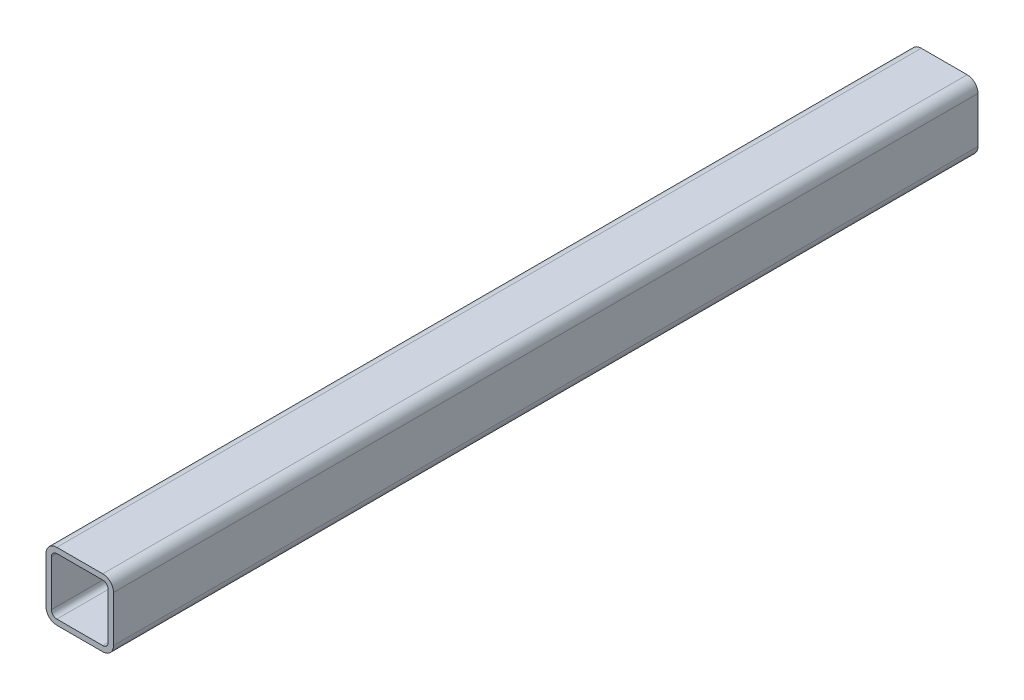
from build123d import *

# Parameters (mm, degrees)
ESQUISSE1_W        = 25
ESQUISSE1_H        = 25
ESQUISSE1_W_2      = 21
ESQUISSE1_H_2      = 21
EXTRU_MINCE1_DEPTH = 160
CONG_1_R           = 2
CONG_2_R           = 4


with BuildPart() as part:
    # Esquisse1 → Extru.-Mince1 (new, symmetric)
    with BuildSketch(Plane.XY):
        Rectangle(ESQUISSE1_W, ESQUISSE1_H)
        Rectangle(ESQUISSE1_W_2, ESQUISSE1_H_2, mode=Mode.SUBTRACT)
    extrude(amount=EXTRU_MINCE1_DEPTH, both=True)

    # Cong_1
    cong_1_edges = [part.edges().sort_by_distance(p)[0] for p in [
        (10.5, -10.5, 0),
        (10.5, 10.5, 0),
        (-10.5, 10.5, 0),
        (-10.5, -10.5, 0),
    ]]
    fillet(cong_1_edges, radius=CONG_1_R)

    # Cong_2
    cong_2_edges = [part.edges().sort_by_distance(p)[0] for p in [
        (12.5, -12.5, 0),
        (-12.5, -12.5, 0),
        (-12.5, 12.5, 0),
        (12.5, 12.5, 0),
    ]]
    fillet(cong_2_edges, radius=CONG_2_R)


solid = part.part
